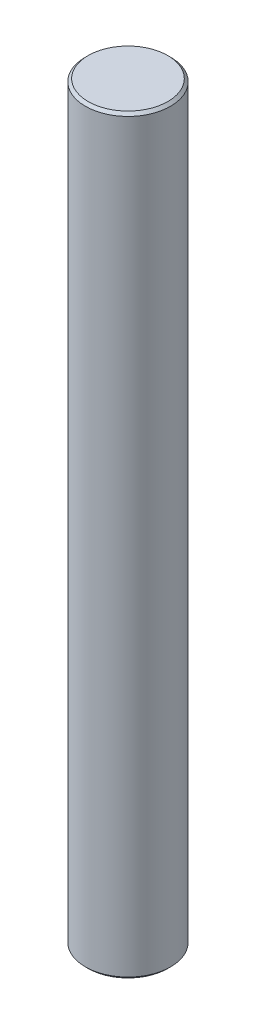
from build123d import *

# Parameters (mm, degrees)
SKETCH1_R      = 3.9624
EXTRUDE1_DEPTH = 34.925
CHAMFER1_SIZE  = 0.254


with BuildPart() as part:
    # Sketch1 → Extrude1 (new, symmetric)
    with BuildSketch(Plane(origin=(0, 0, 0), x_dir=(1, 0, 0), z_dir=(0, 1, 0))):
        with Locations(Location((0, 0, 0), (0, 0, 270))):
            Circle(SKETCH1_R)
    extrude(amount=EXTRUDE1_DEPTH, both=True)

    # Chamfer1
    chamfer1_edges = [part.edges().sort_by_distance(p)[0] for p in [
        (0, -34.925, -3.9624),
        (0, 34.925, -3.9624),
    ]]
    chamfer(chamfer1_edges, length=CHAMFER1_SIZE)


solid = part.part
